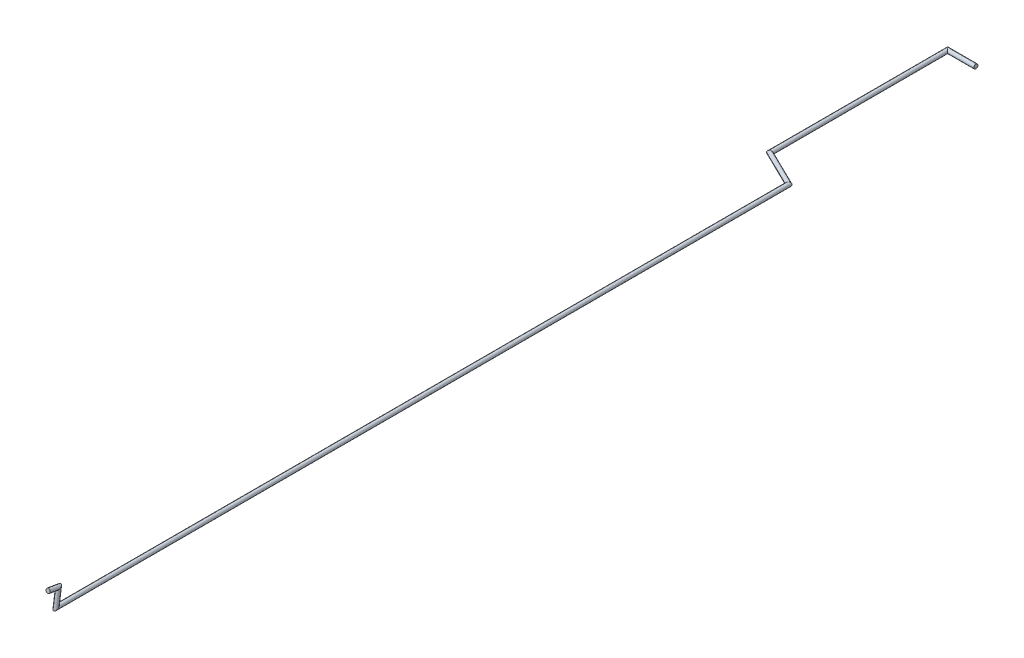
from build123d import *

# Parameters (mm, degrees)
ESQUISSE1_R = 0.6


with BuildPart() as part:
    # Balayage1: sweep along a curve in space
    with BuildLine() as balayage1_path:
        Line((0, 0, 0), (-8.1, 0, 0))
        Line((-8.1, 0, 0), (-8.1, 0, 51))
        Line((-8.1, 0, 51), (2.4, 0, 56.12119218))
        Line((2.4, 0, 56.12119218), (2.4, 0, 266.267029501))
        Line((2.4, 0, 266.267029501), (2.4, 4.72593118, 265.608730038))
        Line((2.4, 4.72593118, 265.608730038), (2.4, 5.215694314, 268.568482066))
    # Esquisse1 → Balayage1 (sweep)
    with BuildSketch(Plane(origin=(0, 0, 0), x_dir=(0, 0, -1), z_dir=(1, 0, 0))):
        Circle(ESQUISSE1_R)
    sweep(path=balayage1_path.line, transition=Transition.RIGHT)


solid = part.part
